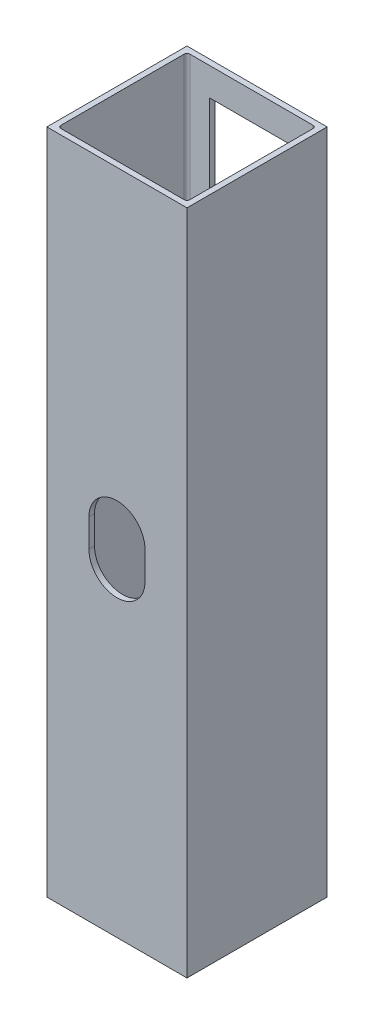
from build123d import *

# Parameters (mm, degrees)
SKETCH2_W           = 63.5
SKETCH2_H           = 63.5
BOSS_EXTRUDE2_DEPTH = 304.8
SKETCH3_W           = 58.42
SKETCH3_H           = 58.42
CUT_EXTRUDE2_DEPTH  = 302.26
SKETCH5_W           = 63.5
SKETCH5_H           = 63.5
CUT_EXTRUDE3_DEPTH  = 2.54
SKETCH6_R           = 12.7
CUT_EXTRUDE4_DEPTH  = 12.7
SKETCH11_R          = 12.7
CUT_EXTRUDE7_DEPTH  = 2.54
CUT_EXTRUDE8_DEPTH  = 2.54
SKETCH14_W          = 38.1
SKETCH14_H          = 276.86
CUT_EXTRUDE9_DEPTH  = 2.54
FILLET1_R           = 1.27


with BuildPart() as part:
    # Sketch2 → Boss-Extrude2 (new body)
    with BuildSketch(Plane(origin=(0, 0, 0), x_dir=(1, 0, 0), z_dir=(0, 1, 0))):
        with Locations((31.75, 31.75)):
            Rectangle(SKETCH2_W, SKETCH2_H)
    extrude(amount=-BOSS_EXTRUDE2_DEPTH)

    # Sketch3 → Cut-Extrude2 (cut)
    with BuildSketch(Plane(origin=(0, 0, 0), x_dir=(1, 0, 0), z_dir=(0, 1, 0))):
        with Locations((31.75, 31.75)):
            Rectangle(SKETCH3_W, SKETCH3_H)
    extrude(amount=-CUT_EXTRUDE2_DEPTH, mode=Mode.SUBTRACT)

    # Sketch5 → Cut-Extrude3 (cut)
    with BuildSketch(Plane(origin=(0, 0, 0), x_dir=(1, 0, 0), z_dir=(0, 1, 0))):
        with Locations((31.75, 31.75)):
            Rectangle(SKETCH5_W, SKETCH5_H)
    extrude(amount=-CUT_EXTRUDE3_DEPTH, mode=Mode.SUBTRACT)

    # Sketch6 → Cut-Extrude4 (cut)
    with BuildSketch(Plane.XY):
        with Locations((31.75, -152.4)):
            Circle(SKETCH6_R)
    extrude(amount=-CUT_EXTRUDE4_DEPTH, mode=Mode.SUBTRACT)

    # Sketch11 → Cut-Extrude7 (cut)
    with BuildSketch(Plane.XY):
        with BuildLine():
            ThreePointArc((19.453277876, -155.575), (19.151222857, -154.000254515), (19.05, -152.4))
            Line((19.05, -152.4), (19.05, -158.75))
            ThreePointArc((19.05, -158.75), (19.151222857, -157.149745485), (19.453277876, -155.575))
        make_face()
        with Locations((31.75, -158.75)):
            Circle(SKETCH11_R)
        with Locations((31.75, -152.4)):
            Circle(SKETCH11_R)
        with BuildLine():
            Line((44.45, -158.75), (44.45, -152.4))
            ThreePointArc((44.45, -152.4), (44.348777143, -154.000254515), (44.046722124, -155.575))
            ThreePointArc((44.046722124, -155.575), (44.348777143, -157.149745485), (44.45, -158.75))
        make_face()
    extrude(amount=-CUT_EXTRUDE7_DEPTH, mode=Mode.SUBTRACT)

    # Sketch12 → Cut-Extrude8 (cut)
    with BuildSketch(Plane.XY):
        with BuildLine():
            ThreePointArc((44.45, -146.05), (31.75, -133.35), (19.05, -146.05))
            ThreePointArc((19.05, -146.05), (19.151222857, -147.650254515), (19.453277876, -149.225))
            ThreePointArc((19.453277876, -149.225), (31.75, -139.7), (44.046722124, -149.225))
            ThreePointArc((44.046722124, -149.225), (44.348777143, -147.650254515), (44.45, -146.05))
        make_face()
        with BuildLine():
            ThreePointArc((19.453277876, -149.225), (19.151222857, -147.650254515), (19.05, -146.05))
            Line((19.05, -146.05), (19.05, -152.4))
            ThreePointArc((19.05, -152.4), (19.151222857, -150.799745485), (19.453277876, -149.225))
        make_face()
        with BuildLine():
            Line((44.45, -152.4), (44.45, -146.05))
            ThreePointArc((44.45, -146.05), (44.348777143, -147.650254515), (44.046722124, -149.225))
            ThreePointArc((44.046722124, -149.225), (44.348777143, -150.799745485), (44.45, -152.4))
        make_face()
    extrude(amount=-CUT_EXTRUDE8_DEPTH, mode=Mode.SUBTRACT)

    # Sketch14 → Cut-Extrude9 (cut)
    with BuildSketch(Plane(origin=(0, 0, -63.5), x_dir=(-1, 0, 0), z_dir=(0, 0, -1))):
        with Locations((-31.75, -153.67)):
            Rectangle(SKETCH14_W, SKETCH14_H)
    extrude(amount=-CUT_EXTRUDE9_DEPTH, mode=Mode.SUBTRACT)

    # Fillet1
    fillet1_edges = [part.edges().sort_by_distance(p)[0] for p in [
        (60.96, -152.4, -2.54),
        (2.54, -152.4, -2.54),
        (2.54, -152.4, -60.96),
        (60.96, -152.4, -60.96),
    ]]
    fillet(fillet1_edges, radius=FILLET1_R)


solid = part.part
